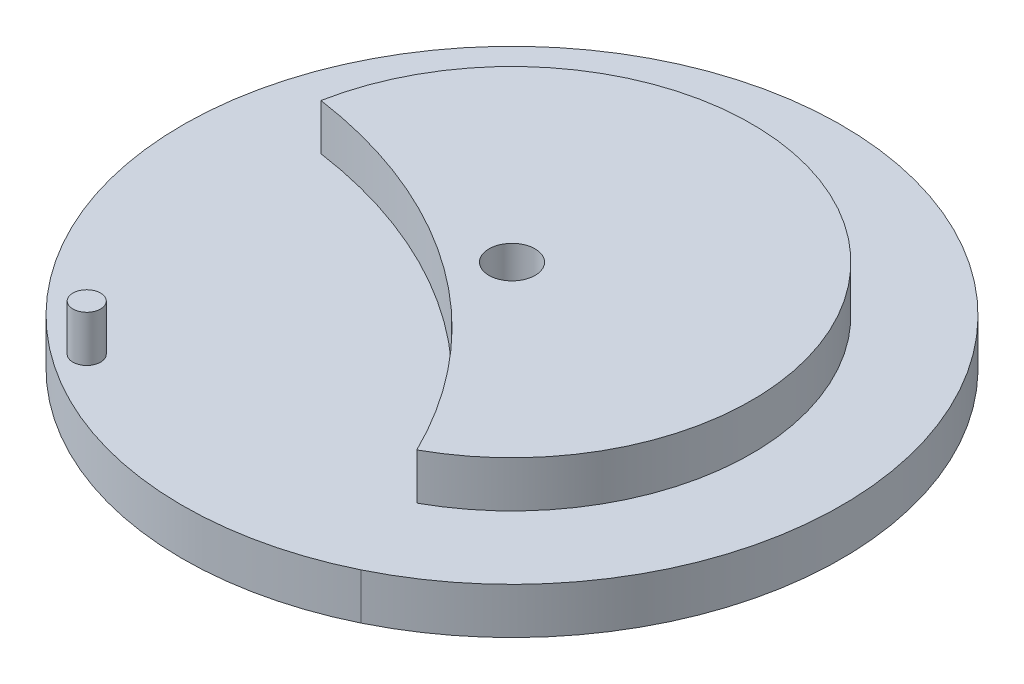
ISO-10303-21;
HEADER;
FILE_DESCRIPTION(('STEP AP214'),'2;1');
FILE_NAME('part.step','',(''),(''),'','','');
FILE_SCHEMA(('AUTOMOTIVE_DESIGN { 1 0 10303 214 1 1 1 1 }'));
ENDSEC;
DATA;
#1=APPLICATION_CONTEXT('core data for automotive mechanical design processes');
#2=APPLICATION_PROTOCOL_DEFINITION('international standard','automotive_design',2000,#1);
#3=PRODUCT_CONTEXT('',#1,'mechanical');
#4=PRODUCT('Part','Part','',(#3));
#5=PRODUCT_RELATED_PRODUCT_CATEGORY('part','',(#4));
#6=PRODUCT_DEFINITION_FORMATION('','',#4);
#7=PRODUCT_DEFINITION_CONTEXT('part definition',#1,'design');
#8=PRODUCT_DEFINITION('design','',#6,#7);
#9=PRODUCT_DEFINITION_SHAPE('','',#8);
#10=(LENGTH_UNIT() NAMED_UNIT(*) SI_UNIT(.MILLI.,.METRE.));
#11=(NAMED_UNIT(*) PLANE_ANGLE_UNIT() SI_UNIT($,.RADIAN.));
#12=(NAMED_UNIT(*) SI_UNIT($,.STERADIAN.) SOLID_ANGLE_UNIT());
#13=UNCERTAINTY_MEASURE_WITH_UNIT(LENGTH_MEASURE(1.E-05),#10,'distance_accuracy_value','');
#14=(GEOMETRIC_REPRESENTATION_CONTEXT(3) GLOBAL_UNCERTAINTY_ASSIGNED_CONTEXT((#13)) GLOBAL_UNIT_ASSIGNED_CONTEXT((#10,
#11,#12)) REPRESENTATION_CONTEXT('',''));
#15=CARTESIAN_POINT('',(0.,0.,0.));
#16=DIRECTION('',(0.,0.,1.));
#17=DIRECTION('',(1.,0.,0.));
#18=AXIS2_PLACEMENT_3D('',#15,#16,#17);
#19=CARTESIAN_POINT('',(65.2836420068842,10.,-89.8552245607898));
#20=DIRECTION('',(0.,-1.,0.));
#21=DIRECTION('',(0.,0.,-1.));
#22=AXIS2_PLACEMENT_3D('',#19,#20,#21);
#23=CYLINDRICAL_SURFACE('',#22,52.);
#24=CARTESIAN_POINT('',(65.2836420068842,0.,-89.8552245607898));
#25=DIRECTION('',(0.,1.,0.));
#26=DIRECTION('',(0.,0.,1.));
#27=AXIS2_PLACEMENT_3D('',#24,#25,#26);
#28=CIRCLE('',#27,52.);
#29=CARTESIAN_POINT('',(90.2410190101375,0.,-44.2358281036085));
#30=VERTEX_POINT('',#29);
#31=CARTESIAN_POINT('',(14.1847641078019,0.,-99.4939318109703));
#32=VERTEX_POINT('',#31);
#33=EDGE_CURVE('E160',#30,#32,#28,.T.);
#34=ORIENTED_EDGE('',*,*,#33,.T.);
#35=DIRECTION('',(0.,-1.,0.));
#36=VECTOR('',#35,1.);
#37=CARTESIAN_POINT('',(14.1847641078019,10.,-99.4939318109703));
#38=LINE('',#37,#36);
#39=CARTESIAN_POINT('',(14.1847641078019,10.,-99.4939318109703));
#40=VERTEX_POINT('',#39);
#41=EDGE_CURVE('E12',#40,#32,#38,.T.);
#42=ORIENTED_EDGE('',*,*,#41,.F.);
#43=CARTESIAN_POINT('',(65.2836420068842,10.,-89.8552245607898));
#44=DIRECTION('',(0.,1.,0.));
#45=DIRECTION('',(0.,0.,1.));
#46=AXIS2_PLACEMENT_3D('',#43,#44,#45);
#47=CIRCLE('',#46,52.);
#48=CARTESIAN_POINT('',(90.2410190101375,10.,-44.2358281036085));
#49=VERTEX_POINT('',#48);
#50=EDGE_CURVE('E171',#49,#40,#47,.T.);
#51=ORIENTED_EDGE('',*,*,#50,.F.);
#52=DIRECTION('',(0.,-1.,0.));
#53=VECTOR('',#52,1.);
#54=CARTESIAN_POINT('',(90.2410190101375,10.,-44.2358281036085));
#55=LINE('',#54,#53);
#56=EDGE_CURVE('E55',#49,#30,#55,.T.);
#57=ORIENTED_EDGE('',*,*,#56,.T.);
#58=EDGE_LOOP('',(#34,#42,#51,#57));
#59=FACE_BOUND('',#58,.T.);
#60=ADVANCED_FACE('F46',(#59),#23,.T.);
#61=CARTESIAN_POINT('',(65.2836420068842,10.,-89.8552245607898));
#62=DIRECTION('',(0.,-1.,0.));
#63=DIRECTION('',(0.,0.,-1.));
#64=AXIS2_PLACEMENT_3D('',#61,#62,#63);
#65=CYLINDRICAL_SURFACE('',#64,5.00000000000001);
#66=CARTESIAN_POINT('',(65.2836420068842,10.,-89.8552245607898));
#67=DIRECTION('',(0.,1.,0.));
#68=DIRECTION('',(0.,0.,1.));
#69=AXIS2_PLACEMENT_3D('',#66,#67,#68);
#70=CIRCLE('',#69,5.00000000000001);
#71=CARTESIAN_POINT('',(65.2836420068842,10.,-84.8552245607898));
#72=VERTEX_POINT('',#71);
#73=EDGE_CURVE('E168',#72,#72,#70,.T.);
#74=ORIENTED_EDGE('',*,*,#73,.T.);
#75=EDGE_LOOP('',(#74));
#76=FACE_BOUND('',#75,.T.);
#77=CARTESIAN_POINT('',(65.2836420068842,-10.,-89.8552245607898));
#78=DIRECTION('',(0.,1.,0.));
#79=DIRECTION('',(0.,0.,1.));
#80=AXIS2_PLACEMENT_3D('',#77,#78,#79);
#81=CIRCLE('',#80,5.00000000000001);
#82=CARTESIAN_POINT('',(65.2836420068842,-10.,-84.8552245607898));
#83=VERTEX_POINT('',#82);
#84=EDGE_CURVE('E133',#83,#83,#81,.T.);
#85=ORIENTED_EDGE('',*,*,#84,.F.);
#86=EDGE_LOOP('',(#85));
#87=FACE_BOUND('',#86,.T.);
#88=ADVANCED_FACE('F48',(#76,#87),#65,.F.);
#89=CARTESIAN_POINT('',(0.,10.,0.));
#90=DIRECTION('',(0.,-1.,0.));
#91=DIRECTION('',(0.,0.,-1.));
#92=AXIS2_PLACEMENT_3D('',#89,#90,#91);
#93=CYLINDRICAL_SURFACE('',#92,100.5);
#94=CARTESIAN_POINT('',(0.,0.,0.));
#95=DIRECTION('',(0.,1.,0.));
#96=DIRECTION('',(0.,0.,1.));
#97=AXIS2_PLACEMENT_3D('',#94,#95,#96);
#98=CIRCLE('',#97,100.5);
#99=EDGE_CURVE('E172',#30,#32,#98,.T.);
#100=ORIENTED_EDGE('',*,*,#99,.F.);
#101=ORIENTED_EDGE('',*,*,#56,.F.);
#102=CARTESIAN_POINT('',(0.,10.,0.));
#103=DIRECTION('',(0.,1.,0.));
#104=DIRECTION('',(0.,0.,1.));
#105=AXIS2_PLACEMENT_3D('',#102,#103,#104);
#106=CIRCLE('',#105,100.5);
#107=EDGE_CURVE('E174',#49,#40,#106,.T.);
#108=ORIENTED_EDGE('',*,*,#107,.T.);
#109=ORIENTED_EDGE('',*,*,#41,.T.);
#110=EDGE_LOOP('',(#100,#101,#108,#109));
#111=FACE_BOUND('',#110,.T.);
#112=ADVANCED_FACE('F182',(#111),#93,.F.);
#113=CARTESIAN_POINT('',(0.,10.,0.));
#114=DIRECTION('',(0.,1.,0.));
#115=DIRECTION('',(0.,0.,1.));
#116=AXIS2_PLACEMENT_3D('',#113,#114,#115);
#117=PLANE('',#116);
#118=ORIENTED_EDGE('',*,*,#73,.F.);
#119=EDGE_LOOP('',(#118));
#120=FACE_BOUND('',#119,.T.);
#121=ORIENTED_EDGE('',*,*,#50,.T.);
#122=ORIENTED_EDGE('',*,*,#107,.F.);
#123=EDGE_LOOP('',(#121,#122));
#124=FACE_BOUND('',#123,.T.);
#125=ADVANCED_FACE('F186',(#120,#124),#117,.T.);
#126=CARTESIAN_POINT('',(0.,0.,0.));
#127=DIRECTION('',(0.,1.,0.));
#128=DIRECTION('',(0.,0.,1.));
#129=AXIS2_PLACEMENT_3D('',#126,#127,#128);
#130=PLANE('',#129);
#131=CARTESIAN_POINT('',(65.2836420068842,0.,-89.8552245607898));
#132=DIRECTION('',(0.,1.,0.));
#133=DIRECTION('',(0.,0.,1.));
#134=AXIS2_PLACEMENT_3D('',#131,#132,#133);
#135=CIRCLE('',#134,71.5069258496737);
#136=CARTESIAN_POINT('',(-5.52169760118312,0.,-99.8474379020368));
#137=VERTEX_POINT('',#136);
#138=CARTESIAN_POINT('',(96.6668548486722,0.,-25.6031086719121));
#139=VERTEX_POINT('',#138);
#140=EDGE_CURVE('E147',#137,#139,#135,.T.);
#141=ORIENTED_EDGE('',*,*,#140,.T.);
#142=CARTESIAN_POINT('',(0.,0.,0.));
#143=DIRECTION('',(0.,1.,0.));
#144=DIRECTION('',(0.,0.,1.));
#145=AXIS2_PLACEMENT_3D('',#142,#143,#144);
#146=CIRCLE('',#145,100.);
#147=CARTESIAN_POINT('',(96.6612888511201,0.,-25.6241143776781));
#148=VERTEX_POINT('',#147);
#149=EDGE_CURVE('E112',#139,#148,#146,.T.);
#150=ORIENTED_EDGE('',*,*,#149,.T.);
#151=DIRECTION('',(0.951056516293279,0.,-0.309016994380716));
#152=VECTOR('',#151,1.);
#153=CARTESIAN_POINT('',(1.69959346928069,0.,5.23081084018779));
#154=LINE('',#153,#152);
#155=CARTESIAN_POINT('',(96.8052450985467,0.,-25.6708885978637));
#156=VERTEX_POINT('',#155);
#157=EDGE_CURVE('E151',#148,#156,#154,.T.);
#158=ORIENTED_EDGE('',*,*,#157,.T.);
#159=CARTESIAN_POINT('',(-5.5,0.,-100.));
#160=VERTEX_POINT('',#159);
#161=EDGE_CURVE('E149',#156,#160,#135,.T.);
#162=ORIENTED_EDGE('',*,*,#161,.T.);
#163=DIRECTION('',(0.,0.,-1.));
#164=VECTOR('',#163,1.);
#165=CARTESIAN_POINT('',(-5.5,0.,0.));
#166=LINE('',#165,#164);
#167=CARTESIAN_POINT('',(-5.5,0.,-99.8486354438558));
#168=VERTEX_POINT('',#167);
#169=EDGE_CURVE('E154',#168,#160,#166,.T.);
#170=ORIENTED_EDGE('',*,*,#169,.F.);
#171=CARTESIAN_POINT('',(0.,0.,0.));
#172=DIRECTION('',(0.,1.,0.));
#173=DIRECTION('',(0.,0.,1.));
#174=AXIS2_PLACEMENT_3D('',#171,#172,#173);
#175=CIRCLE('',#174,100.);
#176=EDGE_CURVE('E137',#168,#137,#175,.T.);
#177=ORIENTED_EDGE('',*,*,#176,.T.);
#178=EDGE_LOOP('',(#141,#150,#158,#162,#170,#177));
#179=FACE_BOUND('',#178,.T.);
#180=ORIENTED_EDGE('',*,*,#33,.F.);
#181=ORIENTED_EDGE('',*,*,#99,.T.);
#182=EDGE_LOOP('',(#180,#181));
#183=FACE_BOUND('',#182,.T.);
#184=ADVANCED_FACE('F184',(#179,#183),#130,.T.);
#185=CARTESIAN_POINT('',(65.2836420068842,-10.,-89.8552245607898));
#186=DIRECTION('',(0.,1.,0.));
#187=DIRECTION('',(0.,0.,1.));
#188=AXIS2_PLACEMENT_3D('',#185,#186,#187);
#189=CYLINDRICAL_SURFACE('',#188,71.5069258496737);
#190=ORIENTED_EDGE('',*,*,#140,.F.);
#191=DIRECTION('',(0.,1.,0.));
#192=VECTOR('',#191,1.);
#193=CARTESIAN_POINT('',(-5.52169760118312,-10.,-99.8474379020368));
#194=LINE('',#193,#192);
#195=CARTESIAN_POINT('',(-5.52169760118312,-10.,-99.8474379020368));
#196=VERTEX_POINT('',#195);
#197=EDGE_CURVE('E132',#196,#137,#194,.T.);
#198=ORIENTED_EDGE('',*,*,#197,.F.);
#199=CARTESIAN_POINT('',(65.2836420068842,-10.,-89.8552245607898));
#200=DIRECTION('',(0.,1.,0.));
#201=DIRECTION('',(0.,0.,1.));
#202=AXIS2_PLACEMENT_3D('',#199,#200,#201);
#203=CIRCLE('',#202,71.5069258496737);
#204=CARTESIAN_POINT('',(96.6668548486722,-10.,-25.6031086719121));
#205=VERTEX_POINT('',#204);
#206=EDGE_CURVE('E125',#196,#205,#203,.T.);
#207=ORIENTED_EDGE('',*,*,#206,.T.);
#208=DIRECTION('',(0.,1.,0.));
#209=VECTOR('',#208,1.);
#210=CARTESIAN_POINT('',(96.6668548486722,-10.,-25.6031086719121));
#211=LINE('',#210,#209);
#212=EDGE_CURVE('E107',#205,#139,#211,.T.);
#213=ORIENTED_EDGE('',*,*,#212,.T.);
#214=EDGE_LOOP('',(#190,#198,#207,#213));
#215=FACE_BOUND('',#214,.T.);
#216=ADVANCED_FACE('F131',(#215),#189,.T.);
#217=CARTESIAN_POINT('',(0.,-10.,0.));
#218=DIRECTION('',(0.,1.,0.));
#219=DIRECTION('',(0.,0.,1.));
#220=AXIS2_PLACEMENT_3D('',#217,#218,#219);
#221=CYLINDRICAL_SURFACE('',#220,100.);
#222=ORIENTED_EDGE('',*,*,#176,.F.);
#223=DIRECTION('',(0.,1.,0.));
#224=VECTOR('',#223,1.);
#225=CARTESIAN_POINT('',(-5.5,-10.,-99.8486354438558));
#226=LINE('',#225,#224);
#227=CARTESIAN_POINT('',(-5.5,-10.,-99.8486354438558));
#228=VERTEX_POINT('',#227);
#229=EDGE_CURVE('E161',#228,#168,#226,.T.);
#230=ORIENTED_EDGE('',*,*,#229,.F.);
#231=CARTESIAN_POINT('',(0.,-10.,0.));
#232=DIRECTION('',(0.,1.,0.));
#233=DIRECTION('',(0.,0.,1.));
#234=AXIS2_PLACEMENT_3D('',#231,#232,#233);
#235=CIRCLE('',#234,100.);
#236=EDGE_CURVE('E118',#228,#196,#235,.T.);
#237=ORIENTED_EDGE('',*,*,#236,.T.);
#238=ORIENTED_EDGE('',*,*,#197,.T.);
#239=EDGE_LOOP('',(#222,#230,#237,#238));
#240=FACE_BOUND('',#239,.T.);
#241=ADVANCED_FACE('F193',(#240),#221,.T.);
#242=CARTESIAN_POINT('',(-5.5,-10.,0.));
#243=DIRECTION('',(1.,0.,0.));
#244=DIRECTION('',(0.,0.,-1.));
#245=AXIS2_PLACEMENT_3D('',#242,#243,#244);
#246=PLANE('',#245);
#247=ORIENTED_EDGE('',*,*,#169,.T.);
#248=DIRECTION('',(0.,1.,0.));
#249=VECTOR('',#248,1.);
#250=CARTESIAN_POINT('',(-5.5,-10.,-100.));
#251=LINE('',#250,#249);
#252=CARTESIAN_POINT('',(-5.5,-10.,-100.));
#253=VERTEX_POINT('',#252);
#254=EDGE_CURVE('E163',#253,#160,#251,.T.);
#255=ORIENTED_EDGE('',*,*,#254,.F.);
#256=DIRECTION('',(0.,0.,-1.));
#257=VECTOR('',#256,1.);
#258=CARTESIAN_POINT('',(-5.5,-10.,0.));
#259=LINE('',#258,#257);
#260=EDGE_CURVE('E140',#228,#253,#259,.T.);
#261=ORIENTED_EDGE('',*,*,#260,.F.);
#262=ORIENTED_EDGE('',*,*,#229,.T.);
#263=EDGE_LOOP('',(#247,#255,#261,#262));
#264=FACE_BOUND('',#263,.T.);
#265=ADVANCED_FACE('F214',(#264),#246,.F.);
#266=ORIENTED_EDGE('',*,*,#161,.F.);
#267=DIRECTION('',(0.,1.,0.));
#268=VECTOR('',#267,1.);
#269=CARTESIAN_POINT('',(96.8052450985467,-10.,-25.6708885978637));
#270=LINE('',#269,#268);
#271=CARTESIAN_POINT('',(96.8052450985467,-10.,-25.6708885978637));
#272=VERTEX_POINT('',#271);
#273=EDGE_CURVE('E165',#272,#156,#270,.T.);
#274=ORIENTED_EDGE('',*,*,#273,.F.);
#275=EDGE_CURVE('E135',#272,#253,#203,.T.);
#276=ORIENTED_EDGE('',*,*,#275,.T.);
#277=ORIENTED_EDGE('',*,*,#254,.T.);
#278=EDGE_LOOP('',(#266,#274,#276,#277));
#279=FACE_BOUND('',#278,.T.);
#280=ADVANCED_FACE('F195',(#279),#189,.T.);
#281=CARTESIAN_POINT('',(1.69959346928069,-10.,5.23081084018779));
#282=DIRECTION('',(0.309016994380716,0.,0.951056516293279));
#283=DIRECTION('',(0.951056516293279,0.,-0.309016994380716));
#284=AXIS2_PLACEMENT_3D('',#281,#282,#283);
#285=PLANE('',#284);
#286=ORIENTED_EDGE('',*,*,#157,.F.);
#287=DIRECTION('',(0.,1.,0.));
#288=VECTOR('',#287,1.);
#289=CARTESIAN_POINT('',(96.6612888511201,-10.,-25.6241143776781));
#290=LINE('',#289,#288);
#291=CARTESIAN_POINT('',(96.6612888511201,-10.,-25.6241143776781));
#292=VERTEX_POINT('',#291);
#293=EDGE_CURVE('E117',#292,#148,#290,.T.);
#294=ORIENTED_EDGE('',*,*,#293,.F.);
#295=DIRECTION('',(0.951056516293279,0.,-0.309016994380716));
#296=VECTOR('',#295,1.);
#297=CARTESIAN_POINT('',(1.69959346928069,-10.,5.23081084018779));
#298=LINE('',#297,#296);
#299=EDGE_CURVE('E129',#292,#272,#298,.T.);
#300=ORIENTED_EDGE('',*,*,#299,.T.);
#301=ORIENTED_EDGE('',*,*,#273,.T.);
#302=EDGE_LOOP('',(#286,#294,#300,#301));
#303=FACE_BOUND('',#302,.T.);
#304=ADVANCED_FACE('F210',(#303),#285,.T.);
#305=CARTESIAN_POINT('',(0.,-10.,0.));
#306=DIRECTION('',(0.,1.,0.));
#307=DIRECTION('',(0.,0.,1.));
#308=AXIS2_PLACEMENT_3D('',#305,#306,#307);
#309=CYLINDRICAL_SURFACE('',#308,100.);
#310=ORIENTED_EDGE('',*,*,#149,.F.);
#311=ORIENTED_EDGE('',*,*,#212,.F.);
#312=CARTESIAN_POINT('',(0.,-10.,0.));
#313=DIRECTION('',(0.,1.,0.));
#314=DIRECTION('',(0.,0.,1.));
#315=AXIS2_PLACEMENT_3D('',#312,#313,#314);
#316=CIRCLE('',#315,100.);
#317=EDGE_CURVE('E110',#205,#292,#316,.T.);
#318=ORIENTED_EDGE('',*,*,#317,.T.);
#319=ORIENTED_EDGE('',*,*,#293,.T.);
#320=EDGE_LOOP('',(#310,#311,#318,#319));
#321=FACE_BOUND('',#320,.T.);
#322=ADVANCED_FACE('F109',(#321),#309,.T.);
#323=CARTESIAN_POINT('',(0.,-10.,0.));
#324=DIRECTION('',(0.,1.,0.));
#325=DIRECTION('',(0.,0.,1.));
#326=AXIS2_PLACEMENT_3D('',#323,#324,#325);
#327=PLANE('',#326);
#328=ORIENTED_EDGE('',*,*,#84,.T.);
#329=EDGE_LOOP('',(#328));
#330=FACE_BOUND('',#329,.T.);
#331=ORIENTED_EDGE('',*,*,#206,.F.);
#332=ORIENTED_EDGE('',*,*,#236,.F.);
#333=ORIENTED_EDGE('',*,*,#260,.T.);
#334=ORIENTED_EDGE('',*,*,#275,.F.);
#335=ORIENTED_EDGE('',*,*,#299,.F.);
#336=ORIENTED_EDGE('',*,*,#317,.F.);
#337=EDGE_LOOP('',(#331,#332,#333,#334,#335,#336));
#338=FACE_BOUND('',#337,.T.);
#339=ADVANCED_FACE('F123',(#330,#338),#327,.F.);
#340=CLOSED_SHELL('',(#60,#88,#112,#125,#184,#216,#241,#265,#280,#304,#322,#339));
#341=MANIFOLD_SOLID_BREP('B2',#340);
#342=CARTESIAN_POINT('',(26.4503363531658,10.,-36.4057647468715));
#343=DIRECTION('',(0.,-1.,0.));
#344=DIRECTION('',(0.,0.,-1.));
#345=AXIS2_PLACEMENT_3D('',#342,#343,#344);
#346=CYLINDRICAL_SURFACE('',#345,3.);
#347=CARTESIAN_POINT('',(26.4503363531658,10.,-36.4057647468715));
#348=DIRECTION('',(0.,1.,0.));
#349=DIRECTION('',(0.,0.,1.));
#350=AXIS2_PLACEMENT_3D('',#347,#348,#349);
#351=CIRCLE('',#350,3.);
#352=CARTESIAN_POINT('',(26.4503363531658,10.,-33.4057647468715));
#353=VERTEX_POINT('',#352);
#354=EDGE_CURVE('E45',#353,#353,#351,.T.);
#355=ORIENTED_EDGE('',*,*,#354,.F.);
#356=EDGE_LOOP('',(#355));
#357=FACE_BOUND('',#356,.T.);
#358=CARTESIAN_POINT('',(26.4503363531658,0.,-36.4057647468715));
#359=DIRECTION('',(0.,1.,0.));
#360=DIRECTION('',(0.,0.,1.));
#361=AXIS2_PLACEMENT_3D('',#358,#359,#360);
#362=CIRCLE('',#361,3.);
#363=CARTESIAN_POINT('',(26.4503363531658,0.,-33.4057647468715));
#364=VERTEX_POINT('',#363);
#365=EDGE_CURVE('E358',#364,#364,#362,.T.);
#366=ORIENTED_EDGE('',*,*,#365,.T.);
#367=EDGE_LOOP('',(#366));
#368=FACE_BOUND('',#367,.T.);
#369=ADVANCED_FACE('F355',(#357,#368),#346,.T.);
#370=CARTESIAN_POINT('',(0.,10.,0.));
#371=DIRECTION('',(0.,1.,0.));
#372=DIRECTION('',(0.,0.,1.));
#373=AXIS2_PLACEMENT_3D('',#370,#371,#372);
#374=PLANE('',#373);
#375=ORIENTED_EDGE('',*,*,#354,.T.);
#376=EDGE_LOOP('',(#375));
#377=FACE_BOUND('',#376,.T.);
#378=ADVANCED_FACE('F370',(#377),#374,.T.);
#379=CARTESIAN_POINT('',(0.,0.,0.));
#380=DIRECTION('',(0.,1.,0.));
#381=DIRECTION('',(0.,0.,1.));
#382=AXIS2_PLACEMENT_3D('',#379,#380,#381);
#383=PLANE('',#382);
#384=ORIENTED_EDGE('',*,*,#365,.F.);
#385=EDGE_LOOP('',(#384));
#386=FACE_BOUND('',#385,.T.);
#387=ADVANCED_FACE('F368',(#386),#383,.F.);
#388=CLOSED_SHELL('',(#369,#378,#387));
#389=MANIFOLD_SOLID_BREP('B6',#388);
#390=ADVANCED_BREP_SHAPE_REPRESENTATION('',(#18,#341,#389),#14);
#391=SHAPE_DEFINITION_REPRESENTATION(#9,#390);
ENDSEC;
END-ISO-10303-21;
